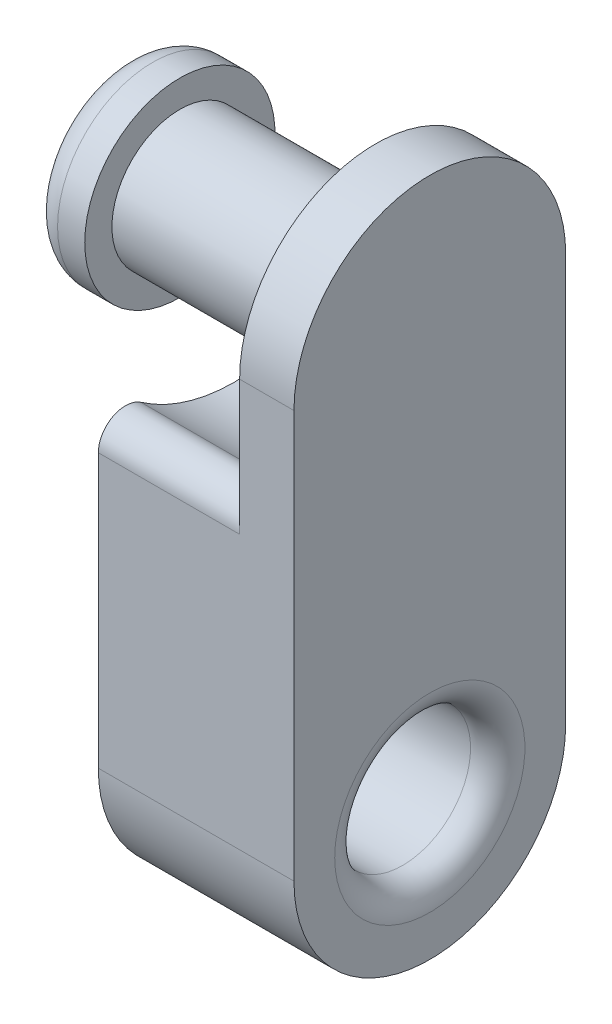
ISO-10303-21;
HEADER;
FILE_DESCRIPTION(('STEP AP214'),'2;1');
FILE_NAME('part.step','',(''),(''),'','','');
FILE_SCHEMA(('AUTOMOTIVE_DESIGN { 1 0 10303 214 1 1 1 1 }'));
ENDSEC;
DATA;
#1=APPLICATION_CONTEXT('core data for automotive mechanical design processes');
#2=APPLICATION_PROTOCOL_DEFINITION('international standard','automotive_design',2000,#1);
#3=PRODUCT_CONTEXT('',#1,'mechanical');
#4=PRODUCT('Part','Part','',(#3));
#5=PRODUCT_RELATED_PRODUCT_CATEGORY('part','',(#4));
#6=PRODUCT_DEFINITION_FORMATION('','',#4);
#7=PRODUCT_DEFINITION_CONTEXT('part definition',#1,'design');
#8=PRODUCT_DEFINITION('design','',#6,#7);
#9=PRODUCT_DEFINITION_SHAPE('','',#8);
#10=(LENGTH_UNIT() NAMED_UNIT(*) SI_UNIT(.MILLI.,.METRE.));
#11=(NAMED_UNIT(*) PLANE_ANGLE_UNIT() SI_UNIT($,.RADIAN.));
#12=(NAMED_UNIT(*) SI_UNIT($,.STERADIAN.) SOLID_ANGLE_UNIT());
#13=UNCERTAINTY_MEASURE_WITH_UNIT(LENGTH_MEASURE(1.E-05),#10,'distance_accuracy_value','');
#14=(GEOMETRIC_REPRESENTATION_CONTEXT(3) GLOBAL_UNCERTAINTY_ASSIGNED_CONTEXT((#13)) GLOBAL_UNIT_ASSIGNED_CONTEXT((#10,
#11,#12)) REPRESENTATION_CONTEXT('',''));
#15=CARTESIAN_POINT('',(0.,0.,0.));
#16=DIRECTION('',(0.,0.,1.));
#17=DIRECTION('',(1.,0.,0.));
#18=AXIS2_PLACEMENT_3D('',#15,#16,#17);
#19=CARTESIAN_POINT('',(0.,19.05,0.));
#20=DIRECTION('',(-1.,0.,0.));
#21=DIRECTION('',(0.,0.,1.));
#22=AXIS2_PLACEMENT_3D('',#19,#20,#21);
#23=PLANE('',#22);
#24=CARTESIAN_POINT('',(0.,19.05,0.));
#25=DIRECTION('',(-1.,0.,0.));
#26=DIRECTION('',(0.,0.,1.));
#27=AXIS2_PLACEMENT_3D('',#24,#25,#26);
#28=CIRCLE('',#27,3.175);
#29=CARTESIAN_POINT('',(0.,19.05,-3.175));
#30=VERTEX_POINT('',#29);
#31=EDGE_CURVE('E176',#30,#30,#28,.T.);
#32=ORIENTED_EDGE('',*,*,#31,.F.);
#33=EDGE_LOOP('',(#32));
#34=FACE_BOUND('',#33,.T.);
#35=CARTESIAN_POINT('',(0.,20.066,0.));
#36=DIRECTION('',(1.,0.,0.));
#37=DIRECTION('',(0.,0.,-1.));
#38=AXIS2_PLACEMENT_3D('',#35,#36,#37);
#39=CIRCLE('',#38,7.62);
#40=CARTESIAN_POINT('',(0.,13.81263323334,4.35428571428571));
#41=VERTEX_POINT('',#40);
#42=CARTESIAN_POINT('',(0.,13.81263323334,-4.35428571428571));
#43=VERTEX_POINT('',#42);
#44=EDGE_CURVE('E159',#41,#43,#39,.T.);
#45=ORIENTED_EDGE('',*,*,#44,.F.);
#46=CARTESIAN_POINT('',(0.,12.7704054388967,5.08));
#47=DIRECTION('',(-1.,0.,0.));
#48=DIRECTION('',(0.,0.,1.));
#49=AXIS2_PLACEMENT_3D('',#46,#47,#48);
#50=CIRCLE('',#49,1.27);
#51=CARTESIAN_POINT('',(0.,12.7704054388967,6.35));
#52=VERTEX_POINT('',#51);
#53=EDGE_CURVE('E72',#41,#52,#50,.F.);
#54=ORIENTED_EDGE('',*,*,#53,.T.);
#55=DIRECTION('',(0.,1.,0.));
#56=VECTOR('',#55,1.);
#57=CARTESIAN_POINT('',(0.,0.,6.35));
#58=LINE('',#57,#56);
#59=CARTESIAN_POINT('',(0.,19.05,6.35));
#60=VERTEX_POINT('',#59);
#61=EDGE_CURVE('E86',#52,#60,#58,.T.);
#62=ORIENTED_EDGE('',*,*,#61,.T.);
#63=CARTESIAN_POINT('',(0.,19.05,0.));
#64=DIRECTION('',(-1.,0.,0.));
#65=DIRECTION('',(0.,0.,1.));
#66=AXIS2_PLACEMENT_3D('',#63,#64,#65);
#67=CIRCLE('',#66,6.35);
#68=CARTESIAN_POINT('',(0.,19.05,-6.35));
#69=VERTEX_POINT('',#68);
#70=EDGE_CURVE('E155',#60,#69,#67,.T.);
#71=ORIENTED_EDGE('',*,*,#70,.T.);
#72=DIRECTION('',(0.,-1.,0.));
#73=VECTOR('',#72,1.);
#74=CARTESIAN_POINT('',(0.,19.05,-6.35));
#75=LINE('',#74,#73);
#76=CARTESIAN_POINT('',(0.,12.7704054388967,-6.35));
#77=VERTEX_POINT('',#76);
#78=EDGE_CURVE('E78',#69,#77,#75,.T.);
#79=ORIENTED_EDGE('',*,*,#78,.T.);
#80=CARTESIAN_POINT('',(0.,12.7704054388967,-5.08));
#81=DIRECTION('',(-1.,0.,0.));
#82=DIRECTION('',(0.,0.,1.));
#83=AXIS2_PLACEMENT_3D('',#80,#81,#82);
#84=CIRCLE('',#83,1.27);
#85=EDGE_CURVE('E12',#77,#43,#84,.F.);
#86=ORIENTED_EDGE('',*,*,#85,.T.);
#87=EDGE_LOOP('',(#45,#54,#62,#71,#79,#86));
#88=FACE_BOUND('',#87,.T.);
#89=ADVANCED_FACE('F64',(#34,#88),#23,.T.);
#90=CARTESIAN_POINT('',(2.54,19.05,0.));
#91=DIRECTION('',(-1.,0.,0.));
#92=DIRECTION('',(0.,0.,1.));
#93=AXIS2_PLACEMENT_3D('',#90,#91,#92);
#94=PLANE('',#93);
#95=CARTESIAN_POINT('',(2.54,0.,0.));
#96=DIRECTION('',(-1.,0.,0.));
#97=DIRECTION('',(0.,0.,1.));
#98=AXIS2_PLACEMENT_3D('',#95,#96,#97);
#99=CIRCLE('',#98,4.445);
#100=CARTESIAN_POINT('',(2.54,0.,4.445));
#101=VERTEX_POINT('',#100);
#102=EDGE_CURVE('E194',#101,#101,#99,.T.);
#103=ORIENTED_EDGE('',*,*,#102,.T.);
#104=EDGE_LOOP('',(#103));
#105=FACE_BOUND('',#104,.T.);
#106=CARTESIAN_POINT('',(2.54,19.05,0.));
#107=DIRECTION('',(-1.,0.,0.));
#108=DIRECTION('',(0.,0.,1.));
#109=AXIS2_PLACEMENT_3D('',#106,#107,#108);
#110=CIRCLE('',#109,6.35);
#111=CARTESIAN_POINT('',(2.54,19.05,6.35));
#112=VERTEX_POINT('',#111);
#113=CARTESIAN_POINT('',(2.54,19.05,-6.35));
#114=VERTEX_POINT('',#113);
#115=EDGE_CURVE('E163',#112,#114,#110,.T.);
#116=ORIENTED_EDGE('',*,*,#115,.F.);
#117=DIRECTION('',(0.,1.,0.));
#118=VECTOR('',#117,1.);
#119=CARTESIAN_POINT('',(2.54,0.,6.35));
#120=LINE('',#119,#118);
#121=CARTESIAN_POINT('',(2.54,0.,6.35));
#122=VERTEX_POINT('',#121);
#123=EDGE_CURVE('E170',#122,#112,#120,.T.);
#124=ORIENTED_EDGE('',*,*,#123,.F.);
#125=CARTESIAN_POINT('',(2.54,0.,0.));
#126=DIRECTION('',(1.,0.,0.));
#127=DIRECTION('',(0.,0.,-1.));
#128=AXIS2_PLACEMENT_3D('',#125,#126,#127);
#129=CIRCLE('',#128,6.35);
#130=CARTESIAN_POINT('',(2.54,0.,-6.35));
#131=VERTEX_POINT('',#130);
#132=EDGE_CURVE('E135',#122,#131,#129,.T.);
#133=ORIENTED_EDGE('',*,*,#132,.T.);
#134=DIRECTION('',(0.,-1.,0.));
#135=VECTOR('',#134,1.);
#136=CARTESIAN_POINT('',(2.54,19.05,-6.35));
#137=LINE('',#136,#135);
#138=EDGE_CURVE('E166',#114,#131,#137,.T.);
#139=ORIENTED_EDGE('',*,*,#138,.F.);
#140=EDGE_LOOP('',(#116,#124,#133,#139));
#141=FACE_BOUND('',#140,.T.);
#142=ADVANCED_FACE('F248',(#105,#141),#94,.F.);
#143=CARTESIAN_POINT('',(2.54,19.05,0.));
#144=DIRECTION('',(-1.,0.,0.));
#145=DIRECTION('',(0.,0.,1.));
#146=AXIS2_PLACEMENT_3D('',#143,#144,#145);
#147=CYLINDRICAL_SURFACE('',#146,6.35);
#148=ORIENTED_EDGE('',*,*,#70,.F.);
#149=DIRECTION('',(-1.,0.,0.));
#150=VECTOR('',#149,1.);
#151=CARTESIAN_POINT('',(2.54,19.05,6.35));
#152=LINE('',#151,#150);
#153=EDGE_CURVE('E138',#112,#60,#152,.T.);
#154=ORIENTED_EDGE('',*,*,#153,.F.);
#155=ORIENTED_EDGE('',*,*,#115,.T.);
#156=DIRECTION('',(-1.,0.,0.));
#157=VECTOR('',#156,1.);
#158=CARTESIAN_POINT('',(2.54,19.05,-6.35));
#159=LINE('',#158,#157);
#160=EDGE_CURVE('E172',#114,#69,#159,.T.);
#161=ORIENTED_EDGE('',*,*,#160,.T.);
#162=EDGE_LOOP('',(#148,#154,#155,#161));
#163=FACE_BOUND('',#162,.T.);
#164=ADVANCED_FACE('F254',(#163),#147,.T.);
#165=CARTESIAN_POINT('',(2.54,0.,6.35));
#166=DIRECTION('',(0.,0.,1.));
#167=DIRECTION('',(1.,0.,0.));
#168=AXIS2_PLACEMENT_3D('',#165,#166,#167);
#169=PLANE('',#168);
#170=ORIENTED_EDGE('',*,*,#61,.F.);
#171=DIRECTION('',(-1.,0.,0.));
#172=VECTOR('',#171,1.);
#173=CARTESIAN_POINT('',(-6.604,12.7704054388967,6.35));
#174=LINE('',#173,#172);
#175=CARTESIAN_POINT('',(-6.604,12.7704054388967,6.35));
#176=VERTEX_POINT('',#175);
#177=EDGE_CURVE('E145',#52,#176,#174,.T.);
#178=ORIENTED_EDGE('',*,*,#177,.T.);
#179=DIRECTION('',(0.,1.,0.));
#180=VECTOR('',#179,1.);
#181=CARTESIAN_POINT('',(-6.604,0.,6.35));
#182=LINE('',#181,#180);
#183=CARTESIAN_POINT('',(-6.604,0.,6.35));
#184=VERTEX_POINT('',#183);
#185=EDGE_CURVE('E142',#184,#176,#182,.T.);
#186=ORIENTED_EDGE('',*,*,#185,.F.);
#187=DIRECTION('',(-1.,0.,0.));
#188=VECTOR('',#187,1.);
#189=CARTESIAN_POINT('',(2.54,0.,6.35));
#190=LINE('',#189,#188);
#191=EDGE_CURVE('E129',#122,#184,#190,.T.);
#192=ORIENTED_EDGE('',*,*,#191,.F.);
#193=ORIENTED_EDGE('',*,*,#123,.T.);
#194=ORIENTED_EDGE('',*,*,#153,.T.);
#195=EDGE_LOOP('',(#170,#178,#186,#192,#193,#194));
#196=FACE_BOUND('',#195,.T.);
#197=ADVANCED_FACE('F143',(#196),#169,.T.);
#198=CARTESIAN_POINT('',(2.54,0.,0.));
#199=DIRECTION('',(-1.,0.,0.));
#200=DIRECTION('',(0.,0.,1.));
#201=AXIS2_PLACEMENT_3D('',#198,#199,#200);
#202=CYLINDRICAL_SURFACE('',#201,6.35);
#203=ORIENTED_EDGE('',*,*,#191,.T.);
#204=CARTESIAN_POINT('',(-6.604,0.,0.));
#205=DIRECTION('',(1.,0.,0.));
#206=DIRECTION('',(0.,0.,-1.));
#207=AXIS2_PLACEMENT_3D('',#204,#205,#206);
#208=CIRCLE('',#207,6.35);
#209=CARTESIAN_POINT('',(-6.604,0.,-6.35));
#210=VERTEX_POINT('',#209);
#211=EDGE_CURVE('E134',#184,#210,#208,.T.);
#212=ORIENTED_EDGE('',*,*,#211,.T.);
#213=DIRECTION('',(-1.,0.,0.));
#214=VECTOR('',#213,1.);
#215=CARTESIAN_POINT('',(2.54,0.,-6.35));
#216=LINE('',#215,#214);
#217=EDGE_CURVE('E139',#131,#210,#216,.T.);
#218=ORIENTED_EDGE('',*,*,#217,.F.);
#219=ORIENTED_EDGE('',*,*,#132,.F.);
#220=EDGE_LOOP('',(#203,#212,#218,#219));
#221=FACE_BOUND('',#220,.T.);
#222=ADVANCED_FACE('F131',(#221),#202,.T.);
#223=CARTESIAN_POINT('',(2.54,19.05,-6.35));
#224=DIRECTION('',(0.,0.,-1.));
#225=DIRECTION('',(0.,1.,0.));
#226=AXIS2_PLACEMENT_3D('',#223,#224,#225);
#227=PLANE('',#226);
#228=DIRECTION('',(0.,-1.,0.));
#229=VECTOR('',#228,1.);
#230=CARTESIAN_POINT('',(-6.604,0.,-6.35));
#231=LINE('',#230,#229);
#232=CARTESIAN_POINT('',(-6.604,12.7704054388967,-6.35));
#233=VERTEX_POINT('',#232);
#234=EDGE_CURVE('E152',#233,#210,#231,.T.);
#235=ORIENTED_EDGE('',*,*,#234,.F.);
#236=DIRECTION('',(-1.,0.,0.));
#237=VECTOR('',#236,1.);
#238=CARTESIAN_POINT('',(0.,12.7704054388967,-6.35));
#239=LINE('',#238,#237);
#240=EDGE_CURVE('E210',#233,#77,#239,.F.);
#241=ORIENTED_EDGE('',*,*,#240,.T.);
#242=ORIENTED_EDGE('',*,*,#78,.F.);
#243=ORIENTED_EDGE('',*,*,#160,.F.);
#244=ORIENTED_EDGE('',*,*,#138,.T.);
#245=ORIENTED_EDGE('',*,*,#217,.T.);
#246=EDGE_LOOP('',(#235,#241,#242,#243,#244,#245));
#247=FACE_BOUND('',#246,.T.);
#248=ADVANCED_FACE('F264',(#247),#227,.T.);
#249=CARTESIAN_POINT('',(2.54,0.,0.));
#250=DIRECTION('',(-1.,0.,0.));
#251=DIRECTION('',(0.,0.,1.));
#252=AXIS2_PLACEMENT_3D('',#249,#250,#251);
#253=CYLINDRICAL_SURFACE('',#252,3.175);
#254=CARTESIAN_POINT('',(1.27,0.,0.));
#255=DIRECTION('',(-1.,0.,0.));
#256=DIRECTION('',(0.,0.,1.));
#257=AXIS2_PLACEMENT_3D('',#254,#255,#256);
#258=CIRCLE('',#257,3.175);
#259=CARTESIAN_POINT('',(1.27,0.,3.175));
#260=VERTEX_POINT('',#259);
#261=EDGE_CURVE('E191',#260,#260,#258,.F.);
#262=ORIENTED_EDGE('',*,*,#261,.T.);
#263=EDGE_LOOP('',(#262));
#264=FACE_BOUND('',#263,.T.);
#265=CARTESIAN_POINT('',(-5.334,0.,0.));
#266=DIRECTION('',(1.,0.,0.));
#267=DIRECTION('',(0.,0.,-1.));
#268=AXIS2_PLACEMENT_3D('',#265,#266,#267);
#269=CIRCLE('',#268,3.175);
#270=CARTESIAN_POINT('',(-5.334,0.,-3.175));
#271=VERTEX_POINT('',#270);
#272=EDGE_CURVE('E188',#271,#271,#269,.F.);
#273=ORIENTED_EDGE('',*,*,#272,.T.);
#274=EDGE_LOOP('',(#273));
#275=FACE_BOUND('',#274,.T.);
#276=ADVANCED_FACE('F267',(#264,#275),#253,.F.);
#277=CARTESIAN_POINT('',(-6.604,20.066,0.));
#278=DIRECTION('',(1.,0.,0.));
#279=DIRECTION('',(0.,0.,-1.));
#280=AXIS2_PLACEMENT_3D('',#277,#278,#279);
#281=CYLINDRICAL_SURFACE('',#280,7.62);
#282=CARTESIAN_POINT('',(-6.604,20.066,0.));
#283=DIRECTION('',(1.,0.,0.));
#284=DIRECTION('',(0.,0.,-1.));
#285=AXIS2_PLACEMENT_3D('',#282,#283,#284);
#286=CIRCLE('',#285,7.62);
#287=CARTESIAN_POINT('',(-6.604,13.81263323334,4.35428571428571));
#288=VERTEX_POINT('',#287);
#289=CARTESIAN_POINT('',(-6.604,13.81263323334,-4.35428571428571));
#290=VERTEX_POINT('',#289);
#291=EDGE_CURVE('E148',#288,#290,#286,.T.);
#292=ORIENTED_EDGE('',*,*,#291,.F.);
#293=DIRECTION('',(1.,0.,0.));
#294=VECTOR('',#293,1.);
#295=CARTESIAN_POINT('',(-6.604,13.81263323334,4.35428571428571));
#296=LINE('',#295,#294);
#297=EDGE_CURVE('E206',#288,#41,#296,.T.);
#298=ORIENTED_EDGE('',*,*,#297,.T.);
#299=ORIENTED_EDGE('',*,*,#44,.T.);
#300=DIRECTION('',(1.,0.,0.));
#301=VECTOR('',#300,1.);
#302=CARTESIAN_POINT('',(-6.604,13.81263323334,-4.35428571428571));
#303=LINE('',#302,#301);
#304=EDGE_CURVE('E204',#43,#290,#303,.F.);
#305=ORIENTED_EDGE('',*,*,#304,.T.);
#306=EDGE_LOOP('',(#292,#298,#299,#305));
#307=FACE_BOUND('',#306,.T.);
#308=ADVANCED_FACE('F220',(#307),#281,.F.);
#309=CARTESIAN_POINT('',(-6.604,0.,0.));
#310=DIRECTION('',(1.,0.,0.));
#311=DIRECTION('',(0.,0.,-1.));
#312=AXIS2_PLACEMENT_3D('',#309,#310,#311);
#313=PLANE('',#312);
#314=CARTESIAN_POINT('',(-6.604,0.,0.));
#315=DIRECTION('',(1.,0.,0.));
#316=DIRECTION('',(0.,0.,-1.));
#317=AXIS2_PLACEMENT_3D('',#314,#315,#316);
#318=CIRCLE('',#317,4.445);
#319=CARTESIAN_POINT('',(-6.604,0.,-4.445));
#320=VERTEX_POINT('',#319);
#321=EDGE_CURVE('E201',#320,#320,#318,.T.);
#322=ORIENTED_EDGE('',*,*,#321,.T.);
#323=EDGE_LOOP('',(#322));
#324=FACE_BOUND('',#323,.T.);
#325=ORIENTED_EDGE('',*,*,#185,.T.);
#326=CARTESIAN_POINT('',(-6.604,12.7704054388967,5.08));
#327=DIRECTION('',(1.,0.,0.));
#328=DIRECTION('',(0.,0.,-1.));
#329=AXIS2_PLACEMENT_3D('',#326,#327,#328);
#330=CIRCLE('',#329,1.27);
#331=EDGE_CURVE('E199',#176,#288,#330,.F.);
#332=ORIENTED_EDGE('',*,*,#331,.T.);
#333=ORIENTED_EDGE('',*,*,#291,.T.);
#334=CARTESIAN_POINT('',(-6.604,12.7704054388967,-5.08));
#335=DIRECTION('',(1.,0.,0.));
#336=DIRECTION('',(0.,0.,-1.));
#337=AXIS2_PLACEMENT_3D('',#334,#335,#336);
#338=CIRCLE('',#337,1.27);
#339=EDGE_CURVE('E197',#290,#233,#338,.F.);
#340=ORIENTED_EDGE('',*,*,#339,.T.);
#341=ORIENTED_EDGE('',*,*,#234,.T.);
#342=ORIENTED_EDGE('',*,*,#211,.F.);
#343=EDGE_LOOP('',(#325,#332,#333,#340,#341,#342));
#344=FACE_BOUND('',#343,.T.);
#345=ADVANCED_FACE('F150',(#324,#344),#313,.F.);
#346=CARTESIAN_POINT('',(-6.604,19.05,0.));
#347=DIRECTION('',(1.,0.,0.));
#348=DIRECTION('',(0.,0.,-1.));
#349=AXIS2_PLACEMENT_3D('',#346,#347,#348);
#350=CYLINDRICAL_SURFACE('',#349,3.175);
#351=CARTESIAN_POINT('',(-9.144,19.05,0.));
#352=DIRECTION('',(-1.,0.,0.));
#353=DIRECTION('',(0.,0.,1.));
#354=AXIS2_PLACEMENT_3D('',#351,#352,#353);
#355=CIRCLE('',#354,3.175);
#356=CARTESIAN_POINT('',(-9.144,19.05,-3.175));
#357=VERTEX_POINT('',#356);
#358=EDGE_CURVE('E162',#357,#357,#355,.T.);
#359=CARTESIAN_POINT('',(0.,19.05,-3.175));
#360=CARTESIAN_POINT('',(-0.0952499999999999,19.05,-3.175));
#361=CARTESIAN_POINT('',(-0.1905,19.05,-3.175));
#362=CARTESIAN_POINT('',(-0.381,19.05,-3.175));
#363=CARTESIAN_POINT('',(-0.47625,19.05,-3.175));
#364=CARTESIAN_POINT('',(-0.66675,19.05,-3.175));
#365=CARTESIAN_POINT('',(-0.762,19.05,-3.175));
#366=CARTESIAN_POINT('',(-0.9525,19.05,-3.175));
#367=CARTESIAN_POINT('',(-1.04775,19.05,-3.175));
#368=CARTESIAN_POINT('',(-1.23825,19.05,-3.175));
#369=CARTESIAN_POINT('',(-1.3335,19.05,-3.175));
#370=CARTESIAN_POINT('',(-1.524,19.05,-3.175));
#371=CARTESIAN_POINT('',(-1.61925,19.05,-3.175));
#372=CARTESIAN_POINT('',(-1.80975,19.05,-3.175));
#373=CARTESIAN_POINT('',(-1.905,19.05,-3.175));
#374=CARTESIAN_POINT('',(-2.0955,19.05,-3.175));
#375=CARTESIAN_POINT('',(-2.19075,19.05,-3.175));
#376=CARTESIAN_POINT('',(-2.38125,19.05,-3.175));
#377=CARTESIAN_POINT('',(-2.4765,19.05,-3.175));
#378=CARTESIAN_POINT('',(-2.667,19.05,-3.175));
#379=CARTESIAN_POINT('',(-2.76225,19.05,-3.175));
#380=CARTESIAN_POINT('',(-2.95275,19.05,-3.175));
#381=CARTESIAN_POINT('',(-3.048,19.05,-3.175));
#382=CARTESIAN_POINT('',(-3.2385,19.05,-3.175));
#383=CARTESIAN_POINT('',(-3.33375,19.05,-3.175));
#384=CARTESIAN_POINT('',(-3.52425,19.05,-3.175));
#385=CARTESIAN_POINT('',(-3.6195,19.05,-3.175));
#386=CARTESIAN_POINT('',(-3.81,19.05,-3.175));
#387=CARTESIAN_POINT('',(-3.90525,19.05,-3.175));
#388=CARTESIAN_POINT('',(-4.09575,19.05,-3.175));
#389=CARTESIAN_POINT('',(-4.191,19.05,-3.175));
#390=CARTESIAN_POINT('',(-4.3815,19.05,-3.175));
#391=CARTESIAN_POINT('',(-4.47675,19.05,-3.175));
#392=CARTESIAN_POINT('',(-4.66725,19.05,-3.175));
#393=CARTESIAN_POINT('',(-4.7625,19.05,-3.175));
#394=CARTESIAN_POINT('',(-4.953,19.05,-3.175));
#395=CARTESIAN_POINT('',(-5.04825,19.05,-3.175));
#396=CARTESIAN_POINT('',(-5.23875,19.05,-3.175));
#397=CARTESIAN_POINT('',(-5.334,19.05,-3.175));
#398=CARTESIAN_POINT('',(-5.5245,19.05,-3.175));
#399=CARTESIAN_POINT('',(-5.61975,19.05,-3.175));
#400=CARTESIAN_POINT('',(-5.81025,19.05,-3.175));
#401=CARTESIAN_POINT('',(-5.9055,19.05,-3.175));
#402=CARTESIAN_POINT('',(-6.096,19.05,-3.175));
#403=CARTESIAN_POINT('',(-6.19125,19.05,-3.175));
#404=CARTESIAN_POINT('',(-6.38175,19.05,-3.175));
#405=CARTESIAN_POINT('',(-6.477,19.05,-3.175));
#406=CARTESIAN_POINT('',(-6.6675,19.05,-3.175));
#407=CARTESIAN_POINT('',(-6.76275,19.05,-3.175));
#408=CARTESIAN_POINT('',(-6.95325,19.05,-3.175));
#409=CARTESIAN_POINT('',(-7.0485,19.05,-3.175));
#410=CARTESIAN_POINT('',(-7.239,19.05,-3.175));
#411=CARTESIAN_POINT('',(-7.33425,19.05,-3.175));
#412=CARTESIAN_POINT('',(-7.52475,19.05,-3.175));
#413=CARTESIAN_POINT('',(-7.62,19.05,-3.175));
#414=CARTESIAN_POINT('',(-7.8105,19.05,-3.175));
#415=CARTESIAN_POINT('',(-7.90575,19.05,-3.175));
#416=CARTESIAN_POINT('',(-8.09625,19.05,-3.175));
#417=CARTESIAN_POINT('',(-8.1915,19.05,-3.175));
#418=CARTESIAN_POINT('',(-8.382,19.05,-3.175));
#419=CARTESIAN_POINT('',(-8.47725,19.05,-3.175));
#420=CARTESIAN_POINT('',(-8.66775,19.05,-3.175));
#421=CARTESIAN_POINT('',(-8.763,19.05,-3.175));
#422=CARTESIAN_POINT('',(-8.9535,19.05,-3.175));
#423=CARTESIAN_POINT('',(-9.04875,19.05,-3.175));
#424=CARTESIAN_POINT('',(-9.144,19.05,-3.175));
#425=B_SPLINE_CURVE_WITH_KNOTS('',3,(#359,#360,#361,#362,#363,#364,#365,#366,#367,#368,#369,
#370,#371,#372,#373,#374,#375,#376,#377,#378,#379,#380,#381,#382,#383,#384,#385,#386,#387,#388,
#389,#390,#391,#392,#393,#394,#395,#396,#397,#398,#399,#400,#401,#402,#403,#404,#405,#406,#407,
#408,#409,#410,#411,#412,#413,#414,#415,#416,#417,#418,#419,#420,#421,#422,#423,#424),
.UNSPECIFIED.,.F.,.F.,(4,2,2,2,2,2,2,2,2,2,2,2,2,2,2,2,2,2,2,2,2,2,2,2,2,2,2,2,2,2,2,2,4),(0.,
0.28575,0.5715,0.85725,1.143,1.42875,1.7145,2.00025,2.286,2.57175,2.8575,3.14325,3.429,3.71475,
4.0005,4.28625,4.572,4.85775,5.1435,5.42925,5.715,6.00075,6.2865,6.57225,6.858,7.14375,7.4295,
7.71525,8.001,8.28675,8.5725,8.85825,9.144),.UNSPECIFIED.);
#426=EDGE_CURVE('BSEAM328',#30,#357,#425,.T.);
#427=ORIENTED_EDGE('',*,*,#31,.T.);
#428=ORIENTED_EDGE('',*,*,#358,.F.);
#429=ORIENTED_EDGE('',*,*,#426,.T.);
#430=ORIENTED_EDGE('',*,*,#426,.F.);
#431=EDGE_LOOP('',(#427,#429,#428,#430));
#432=FACE_BOUND('',#431,.T.);
#433=ADVANCED_FACE('F328',(#432),#350,.T.);
#434=CARTESIAN_POINT('',(-11.684,19.05,0.));
#435=DIRECTION('',(1.,0.,0.));
#436=DIRECTION('',(0.,0.,-1.));
#437=AXIS2_PLACEMENT_3D('',#434,#435,#436);
#438=CYLINDRICAL_SURFACE('',#437,4.445);
#439=CARTESIAN_POINT('',(-10.414,19.05,0.));
#440=DIRECTION('',(-1.,0.,0.));
#441=DIRECTION('',(0.,0.,1.));
#442=AXIS2_PLACEMENT_3D('',#439,#440,#441);
#443=CIRCLE('',#442,4.445);
#444=CARTESIAN_POINT('',(-10.414,19.05,4.445));
#445=VERTEX_POINT('',#444);
#446=EDGE_CURVE('E185',#445,#445,#443,.F.);
#447=ORIENTED_EDGE('',*,*,#446,.T.);
#448=EDGE_LOOP('',(#447));
#449=FACE_BOUND('',#448,.T.);
#450=CARTESIAN_POINT('',(-9.144,19.05,0.));
#451=DIRECTION('',(-1.,0.,0.));
#452=DIRECTION('',(0.,0.,1.));
#453=AXIS2_PLACEMENT_3D('',#450,#451,#452);
#454=CIRCLE('',#453,4.445);
#455=CARTESIAN_POINT('',(-9.144,19.05,4.445));
#456=VERTEX_POINT('',#455);
#457=EDGE_CURVE('E225',#456,#456,#454,.T.);
#458=ORIENTED_EDGE('',*,*,#457,.T.);
#459=EDGE_LOOP('',(#458));
#460=FACE_BOUND('',#459,.T.);
#461=ADVANCED_FACE('F229',(#449,#460),#438,.T.);
#462=CARTESIAN_POINT('',(-11.684,19.05,0.));
#463=DIRECTION('',(-1.,0.,0.));
#464=DIRECTION('',(0.,0.,1.));
#465=AXIS2_PLACEMENT_3D('',#462,#463,#464);
#466=PLANE('',#465);
#467=CARTESIAN_POINT('',(-11.684,19.05,0.));
#468=DIRECTION('',(-1.,0.,0.));
#469=DIRECTION('',(0.,0.,1.));
#470=AXIS2_PLACEMENT_3D('',#467,#468,#469);
#471=CIRCLE('',#470,3.175);
#472=CARTESIAN_POINT('',(-11.684,19.05,3.175));
#473=VERTEX_POINT('',#472);
#474=EDGE_CURVE('E182',#473,#473,#471,.T.);
#475=ORIENTED_EDGE('',*,*,#474,.T.);
#476=EDGE_LOOP('',(#475));
#477=FACE_BOUND('',#476,.T.);
#478=ADVANCED_FACE('F234',(#477),#466,.T.);
#479=CARTESIAN_POINT('',(-9.144,19.05,0.));
#480=DIRECTION('',(-1.,0.,0.));
#481=DIRECTION('',(0.,0.,1.));
#482=AXIS2_PLACEMENT_3D('',#479,#480,#481);
#483=PLANE('',#482);
#484=ORIENTED_EDGE('',*,*,#358,.T.);
#485=EDGE_LOOP('',(#484));
#486=FACE_BOUND('',#485,.T.);
#487=ORIENTED_EDGE('',*,*,#457,.F.);
#488=EDGE_LOOP('',(#487));
#489=FACE_BOUND('',#488,.T.);
#490=ADVANCED_FACE('F231',(#486,#489),#483,.F.);
#491=CARTESIAN_POINT('',(-10.414,19.05,0.));
#492=DIRECTION('',(-1.,0.,0.));
#493=DIRECTION('',(0.,0.,1.));
#494=AXIS2_PLACEMENT_3D('',#491,#492,#493);
#495=TOROIDAL_SURFACE('',#494,3.175,1.27);
#496=ORIENTED_EDGE('',*,*,#446,.F.);
#497=EDGE_LOOP('',(#496));
#498=FACE_BOUND('',#497,.T.);
#499=ORIENTED_EDGE('',*,*,#474,.F.);
#500=EDGE_LOOP('',(#499));
#501=FACE_BOUND('',#500,.T.);
#502=ADVANCED_FACE('F233',(#498,#501),#495,.T.);
#503=CARTESIAN_POINT('',(1.27,0.,0.));
#504=DIRECTION('',(-1.,0.,0.));
#505=DIRECTION('',(0.,0.,1.));
#506=AXIS2_PLACEMENT_3D('',#503,#504,#505);
#507=TOROIDAL_SURFACE('',#506,4.445,1.27);
#508=ORIENTED_EDGE('',*,*,#102,.F.);
#509=EDGE_LOOP('',(#508));
#510=FACE_BOUND('',#509,.T.);
#511=ORIENTED_EDGE('',*,*,#261,.F.);
#512=EDGE_LOOP('',(#511));
#513=FACE_BOUND('',#512,.T.);
#514=ADVANCED_FACE('F241',(#510,#513),#507,.T.);
#515=CARTESIAN_POINT('',(-5.334,0.,0.));
#516=DIRECTION('',(1.,0.,0.));
#517=DIRECTION('',(0.,0.,-1.));
#518=AXIS2_PLACEMENT_3D('',#515,#516,#517);
#519=TOROIDAL_SURFACE('',#518,4.445,1.27);
#520=ORIENTED_EDGE('',*,*,#272,.F.);
#521=EDGE_LOOP('',(#520));
#522=FACE_BOUND('',#521,.T.);
#523=ORIENTED_EDGE('',*,*,#321,.F.);
#524=EDGE_LOOP('',(#523));
#525=FACE_BOUND('',#524,.T.);
#526=ADVANCED_FACE('F274',(#522,#525),#519,.T.);
#527=CARTESIAN_POINT('',(-6.604,12.7704054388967,5.08));
#528=DIRECTION('',(1.,0.,0.));
#529=DIRECTION('',(0.,0.,-1.));
#530=AXIS2_PLACEMENT_3D('',#527,#528,#529);
#531=CYLINDRICAL_SURFACE('',#530,1.27);
#532=ORIENTED_EDGE('',*,*,#331,.F.);
#533=ORIENTED_EDGE('',*,*,#177,.F.);
#534=ORIENTED_EDGE('',*,*,#53,.F.);
#535=ORIENTED_EDGE('',*,*,#297,.F.);
#536=EDGE_LOOP('',(#532,#533,#534,#535));
#537=FACE_BOUND('',#536,.T.);
#538=ADVANCED_FACE('F215',(#537),#531,.T.);
#539=CARTESIAN_POINT('',(-6.604,12.7704054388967,-5.08));
#540=DIRECTION('',(1.,0.,0.));
#541=DIRECTION('',(0.,0.,-1.));
#542=AXIS2_PLACEMENT_3D('',#539,#540,#541);
#543=CYLINDRICAL_SURFACE('',#542,1.27);
#544=ORIENTED_EDGE('',*,*,#339,.F.);
#545=ORIENTED_EDGE('',*,*,#304,.F.);
#546=ORIENTED_EDGE('',*,*,#85,.F.);
#547=ORIENTED_EDGE('',*,*,#240,.F.);
#548=EDGE_LOOP('',(#544,#545,#546,#547));
#549=FACE_BOUND('',#548,.T.);
#550=ADVANCED_FACE('F66',(#549),#543,.T.);
#551=CLOSED_SHELL('',(#89,#142,#164,#197,#222,#248,#276,#308,#345,#433,#461,#478,#490,#502,#514,
#526,#538,#550));
#552=MANIFOLD_SOLID_BREP('B2',#551);
#553=ADVANCED_BREP_SHAPE_REPRESENTATION('',(#18,#552),#14);
#554=SHAPE_DEFINITION_REPRESENTATION(#9,#553);
ENDSEC;
END-ISO-10303-21;
